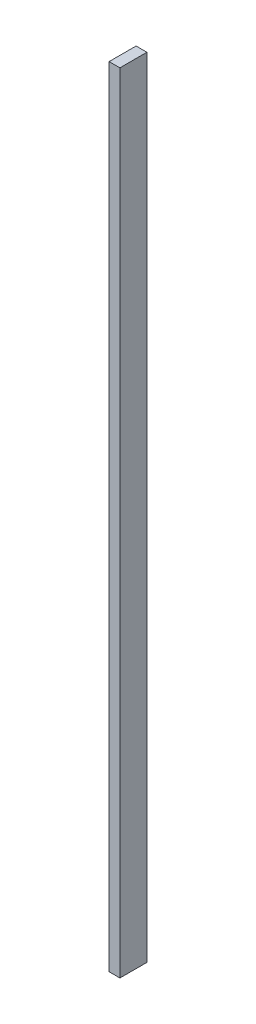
ISO-10303-21;
HEADER;
FILE_DESCRIPTION(('STEP AP214'),'2;1');
FILE_NAME('part.step','',(''),(''),'','','');
FILE_SCHEMA(('AUTOMOTIVE_DESIGN { 1 0 10303 214 1 1 1 1 }'));
ENDSEC;
DATA;
#1=APPLICATION_CONTEXT('core data for automotive mechanical design processes');
#2=APPLICATION_PROTOCOL_DEFINITION('international standard','automotive_design',2000,#1);
#3=PRODUCT_CONTEXT('',#1,'mechanical');
#4=PRODUCT('Part','Part','',(#3));
#5=PRODUCT_RELATED_PRODUCT_CATEGORY('part','',(#4));
#6=PRODUCT_DEFINITION_FORMATION('','',#4);
#7=PRODUCT_DEFINITION_CONTEXT('part definition',#1,'design');
#8=PRODUCT_DEFINITION('design','',#6,#7);
#9=PRODUCT_DEFINITION_SHAPE('','',#8);
#10=(LENGTH_UNIT() NAMED_UNIT(*) SI_UNIT(.MILLI.,.METRE.));
#11=(NAMED_UNIT(*) PLANE_ANGLE_UNIT() SI_UNIT($,.RADIAN.));
#12=(NAMED_UNIT(*) SI_UNIT($,.STERADIAN.) SOLID_ANGLE_UNIT());
#13=UNCERTAINTY_MEASURE_WITH_UNIT(LENGTH_MEASURE(1.E-05),#10,'distance_accuracy_value','');
#14=(GEOMETRIC_REPRESENTATION_CONTEXT(3) GLOBAL_UNCERTAINTY_ASSIGNED_CONTEXT((#13)) GLOBAL_UNIT_ASSIGNED_CONTEXT((#10,
#11,#12)) REPRESENTATION_CONTEXT('',''));
#15=CARTESIAN_POINT('',(0.,0.,0.));
#16=DIRECTION('',(0.,0.,1.));
#17=DIRECTION('',(1.,0.,0.));
#18=AXIS2_PLACEMENT_3D('',#15,#16,#17);
#19=CARTESIAN_POINT('',(0.,1460.,0.));
#20=DIRECTION('',(1.,0.,0.));
#21=DIRECTION('',(0.,0.,-1.));
#22=AXIS2_PLACEMENT_3D('',#19,#20,#21);
#23=PLANE('',#22);
#24=DIRECTION('',(0.,0.,1.));
#25=VECTOR('',#24,1.);
#26=CARTESIAN_POINT('',(0.,0.,0.));
#27=LINE('',#26,#25);
#28=CARTESIAN_POINT('',(0.,0.,-50.));
#29=VERTEX_POINT('',#28);
#30=CARTESIAN_POINT('',(0.,0.,0.));
#31=VERTEX_POINT('',#30);
#32=EDGE_CURVE('E95',#29,#31,#27,.T.);
#33=ORIENTED_EDGE('',*,*,#32,.T.);
#34=DIRECTION('',(0.,-1.,0.));
#35=VECTOR('',#34,1.);
#36=CARTESIAN_POINT('',(0.,1460.,0.));
#37=LINE('',#36,#35);
#38=CARTESIAN_POINT('',(0.,1460.,0.));
#39=VERTEX_POINT('',#38);
#40=EDGE_CURVE('E11',#39,#31,#37,.T.);
#41=ORIENTED_EDGE('',*,*,#40,.F.);
#42=DIRECTION('',(0.,0.,1.));
#43=VECTOR('',#42,1.);
#44=CARTESIAN_POINT('',(0.,1460.,0.));
#45=LINE('',#44,#43);
#46=CARTESIAN_POINT('',(0.,1460.,-50.));
#47=VERTEX_POINT('',#46);
#48=EDGE_CURVE('E83',#47,#39,#45,.T.);
#49=ORIENTED_EDGE('',*,*,#48,.F.);
#50=DIRECTION('',(0.,-1.,0.));
#51=VECTOR('',#50,1.);
#52=CARTESIAN_POINT('',(0.,1460.,-50.));
#53=LINE('',#52,#51);
#54=EDGE_CURVE('E91',#47,#29,#53,.T.);
#55=ORIENTED_EDGE('',*,*,#54,.T.);
#56=EDGE_LOOP('',(#33,#41,#49,#55));
#57=FACE_BOUND('',#56,.T.);
#58=ADVANCED_FACE('F32',(#57),#23,.F.);
#59=CARTESIAN_POINT('',(0.,1460.,0.));
#60=DIRECTION('',(0.,0.,-1.));
#61=DIRECTION('',(-1.,0.,0.));
#62=AXIS2_PLACEMENT_3D('',#59,#60,#61);
#63=PLANE('',#62);
#64=DIRECTION('',(1.,0.,0.));
#65=VECTOR('',#64,1.);
#66=CARTESIAN_POINT('',(0.,0.,0.));
#67=LINE('',#66,#65);
#68=CARTESIAN_POINT('',(20.,0.,0.));
#69=VERTEX_POINT('',#68);
#70=EDGE_CURVE('E87',#31,#69,#67,.T.);
#71=ORIENTED_EDGE('',*,*,#70,.T.);
#72=DIRECTION('',(0.,-1.,0.));
#73=VECTOR('',#72,1.);
#74=CARTESIAN_POINT('',(20.,1460.,0.));
#75=LINE('',#74,#73);
#76=CARTESIAN_POINT('',(20.,1460.,0.));
#77=VERTEX_POINT('',#76);
#78=EDGE_CURVE('E40',#77,#69,#75,.T.);
#79=ORIENTED_EDGE('',*,*,#78,.F.);
#80=DIRECTION('',(1.,0.,0.));
#81=VECTOR('',#80,1.);
#82=CARTESIAN_POINT('',(0.,1460.,0.));
#83=LINE('',#82,#81);
#84=EDGE_CURVE('E78',#39,#77,#83,.T.);
#85=ORIENTED_EDGE('',*,*,#84,.F.);
#86=ORIENTED_EDGE('',*,*,#40,.T.);
#87=EDGE_LOOP('',(#71,#79,#85,#86));
#88=FACE_BOUND('',#87,.T.);
#89=ADVANCED_FACE('F86',(#88),#63,.F.);
#90=CARTESIAN_POINT('',(20.,1460.,0.));
#91=DIRECTION('',(-1.,0.,0.));
#92=DIRECTION('',(0.,0.,1.));
#93=AXIS2_PLACEMENT_3D('',#90,#91,#92);
#94=PLANE('',#93);
#95=DIRECTION('',(0.,0.,-1.));
#96=VECTOR('',#95,1.);
#97=CARTESIAN_POINT('',(20.,0.,0.));
#98=LINE('',#97,#96);
#99=CARTESIAN_POINT('',(20.,0.,-50.));
#100=VERTEX_POINT('',#99);
#101=EDGE_CURVE('E65',#69,#100,#98,.T.);
#102=ORIENTED_EDGE('',*,*,#101,.T.);
#103=DIRECTION('',(0.,-1.,0.));
#104=VECTOR('',#103,1.);
#105=CARTESIAN_POINT('',(20.,1460.,-50.));
#106=LINE('',#105,#104);
#107=CARTESIAN_POINT('',(20.,1460.,-50.));
#108=VERTEX_POINT('',#107);
#109=EDGE_CURVE('E88',#108,#100,#106,.T.);
#110=ORIENTED_EDGE('',*,*,#109,.F.);
#111=DIRECTION('',(0.,0.,-1.));
#112=VECTOR('',#111,1.);
#113=CARTESIAN_POINT('',(20.,1460.,0.));
#114=LINE('',#113,#112);
#115=EDGE_CURVE('E81',#77,#108,#114,.T.);
#116=ORIENTED_EDGE('',*,*,#115,.F.);
#117=ORIENTED_EDGE('',*,*,#78,.T.);
#118=EDGE_LOOP('',(#102,#110,#116,#117));
#119=FACE_BOUND('',#118,.T.);
#120=ADVANCED_FACE('F89',(#119),#94,.F.);
#121=CARTESIAN_POINT('',(0.,1460.,-50.));
#122=DIRECTION('',(0.,0.,1.));
#123=DIRECTION('',(1.,0.,0.));
#124=AXIS2_PLACEMENT_3D('',#121,#122,#123);
#125=PLANE('',#124);
#126=DIRECTION('',(-1.,0.,0.));
#127=VECTOR('',#126,1.);
#128=CARTESIAN_POINT('',(0.,0.,-50.));
#129=LINE('',#128,#127);
#130=EDGE_CURVE('E71',#100,#29,#129,.T.);
#131=ORIENTED_EDGE('',*,*,#130,.T.);
#132=ORIENTED_EDGE('',*,*,#54,.F.);
#133=DIRECTION('',(-1.,0.,0.));
#134=VECTOR('',#133,1.);
#135=CARTESIAN_POINT('',(0.,1460.,-50.));
#136=LINE('',#135,#134);
#137=EDGE_CURVE('E48',#108,#47,#136,.T.);
#138=ORIENTED_EDGE('',*,*,#137,.F.);
#139=ORIENTED_EDGE('',*,*,#109,.T.);
#140=EDGE_LOOP('',(#131,#132,#138,#139));
#141=FACE_BOUND('',#140,.T.);
#142=ADVANCED_FACE('F102',(#141),#125,.F.);
#143=CARTESIAN_POINT('',(0.,1460.,-50.));
#144=DIRECTION('',(0.,-1.,0.));
#145=DIRECTION('',(0.,0.,-1.));
#146=AXIS2_PLACEMENT_3D('',#143,#144,#145);
#147=PLANE('',#146);
#148=ORIENTED_EDGE('',*,*,#48,.T.);
#149=ORIENTED_EDGE('',*,*,#84,.T.);
#150=ORIENTED_EDGE('',*,*,#115,.T.);
#151=ORIENTED_EDGE('',*,*,#137,.T.);
#152=EDGE_LOOP('',(#148,#149,#150,#151));
#153=FACE_BOUND('',#152,.T.);
#154=ADVANCED_FACE('F79',(#153),#147,.F.);
#155=CARTESIAN_POINT('',(0.,0.,-50.));
#156=DIRECTION('',(0.,-1.,0.));
#157=DIRECTION('',(0.,0.,-1.));
#158=AXIS2_PLACEMENT_3D('',#155,#156,#157);
#159=PLANE('',#158);
#160=ORIENTED_EDGE('',*,*,#32,.F.);
#161=ORIENTED_EDGE('',*,*,#130,.F.);
#162=ORIENTED_EDGE('',*,*,#101,.F.);
#163=ORIENTED_EDGE('',*,*,#70,.F.);
#164=EDGE_LOOP('',(#160,#161,#162,#163));
#165=FACE_BOUND('',#164,.T.);
#166=ADVANCED_FACE('F105',(#165),#159,.T.);
#167=CLOSED_SHELL('',(#58,#89,#120,#142,#154,#166));
#168=MANIFOLD_SOLID_BREP('B2',#167);
#169=ADVANCED_BREP_SHAPE_REPRESENTATION('',(#18,#168),#14);
#170=SHAPE_DEFINITION_REPRESENTATION(#9,#169);
ENDSEC;
END-ISO-10303-21;
